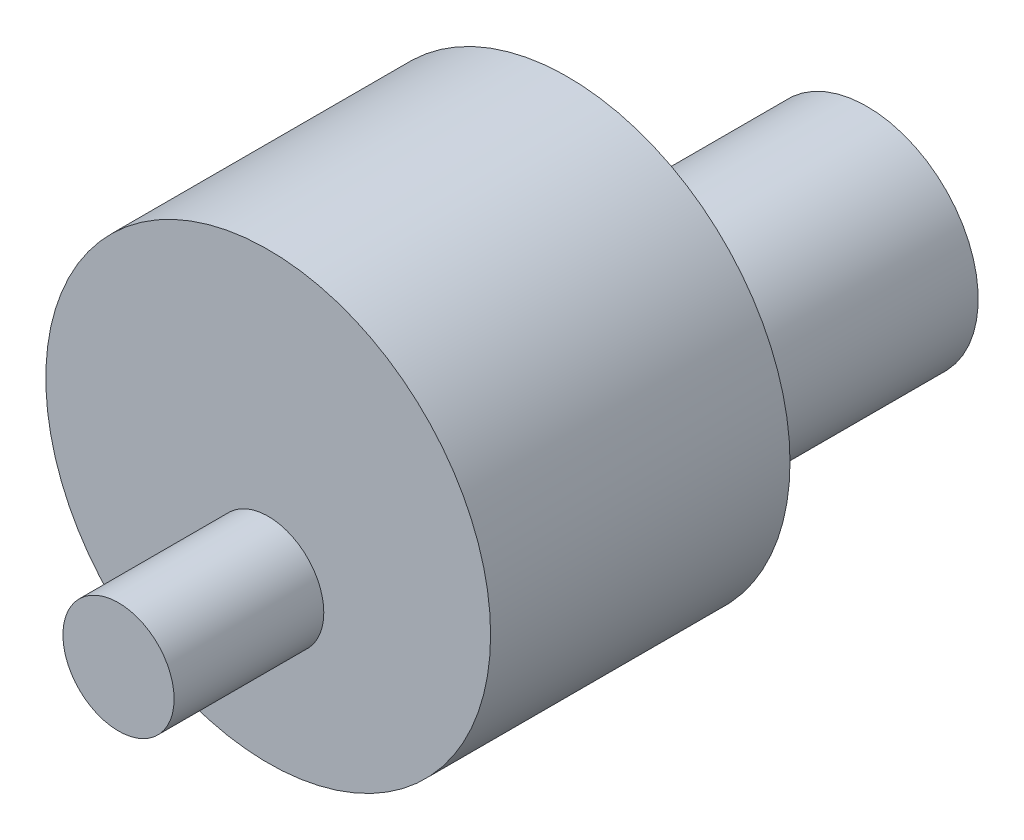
from build123d import *

# Parameters (mm, degrees)
SKETCH2_R           = 132.08
BOSS_EXTRUDE1_DEPTH = 177.8
SKETCH3_R           = 66.04
BOSS_EXTRUDE2_DEPTH = 177.8
SKETCH4_R           = 33.02
BOSS_EXTRUDE3_DEPTH = 88.9


with BuildPart() as part:
    # Sketch2 → Boss-Extrude1 (new body)
    with BuildSketch(Plane.XY):
        Circle(SKETCH2_R)
    extrude(amount=BOSS_EXTRUDE1_DEPTH)

    # Sketch3 → Boss-Extrude2 (add)
    with BuildSketch(Plane(origin=(0, 0, 0), x_dir=(-1, 0, 0), z_dir=(0, 0, -1))):
        with Locations((0, -38.1)):
            Circle(SKETCH3_R)
    extrude(amount=BOSS_EXTRUDE2_DEPTH)

    # Sketch4 → Boss-Extrude3 (add)
    with BuildSketch(Plane.XY.offset(177.8)):
        with Locations((0, -38.1)):
            Circle(SKETCH4_R)
    extrude(amount=BOSS_EXTRUDE3_DEPTH)


solid = part.part
